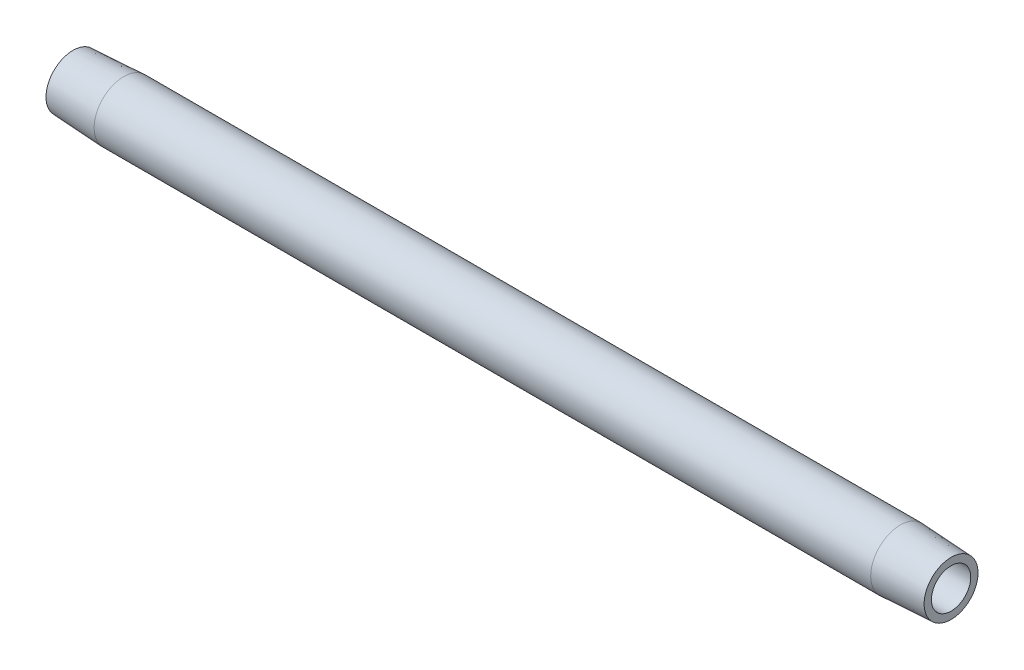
ISO-10303-21;
HEADER;
FILE_DESCRIPTION(('STEP AP214'),'2;1');
FILE_NAME('part.step','',(''),(''),'','','');
FILE_SCHEMA(('AUTOMOTIVE_DESIGN { 1 0 10303 214 1 1 1 1 }'));
ENDSEC;
DATA;
#1=APPLICATION_CONTEXT('core data for automotive mechanical design processes');
#2=APPLICATION_PROTOCOL_DEFINITION('international standard','automotive_design',2000,#1);
#3=PRODUCT_CONTEXT('',#1,'mechanical');
#4=PRODUCT('Part','Part','',(#3));
#5=PRODUCT_RELATED_PRODUCT_CATEGORY('part','',(#4));
#6=PRODUCT_DEFINITION_FORMATION('','',#4);
#7=PRODUCT_DEFINITION_CONTEXT('part definition',#1,'design');
#8=PRODUCT_DEFINITION('design','',#6,#7);
#9=PRODUCT_DEFINITION_SHAPE('','',#8);
#10=(LENGTH_UNIT() NAMED_UNIT(*) SI_UNIT(.MILLI.,.METRE.));
#11=(NAMED_UNIT(*) PLANE_ANGLE_UNIT() SI_UNIT($,.RADIAN.));
#12=(NAMED_UNIT(*) SI_UNIT($,.STERADIAN.) SOLID_ANGLE_UNIT());
#13=UNCERTAINTY_MEASURE_WITH_UNIT(LENGTH_MEASURE(1.E-05),#10,'distance_accuracy_value','');
#14=(GEOMETRIC_REPRESENTATION_CONTEXT(3) GLOBAL_UNCERTAINTY_ASSIGNED_CONTEXT((#13)) GLOBAL_UNIT_ASSIGNED_CONTEXT((#10,
#11,#12)) REPRESENTATION_CONTEXT('',''));
#15=CARTESIAN_POINT('',(0.,0.,0.));
#16=DIRECTION('',(0.,0.,1.));
#17=DIRECTION('',(1.,0.,0.));
#18=AXIS2_PLACEMENT_3D('',#15,#16,#17);
#19=CARTESIAN_POINT('',(0.476141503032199,0.,0.));
#20=DIRECTION('',(-1.,0.,0.));
#21=DIRECTION('',(0.,0.,1.));
#22=AXIS2_PLACEMENT_3D('',#19,#20,#21);
#23=CYLINDRICAL_SURFACE('',#22,5.14349999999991);
#24=CARTESIAN_POINT('',(8.8100393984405,0.,0.));
#25=DIRECTION('',(-1.,0.,0.));
#26=DIRECTION('',(0.,0.,1.));
#27=AXIS2_PLACEMENT_3D('',#24,#25,#26);
#28=CIRCLE('',#27,5.14349999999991);
#29=CARTESIAN_POINT('',(8.8100393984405,0.,5.14349999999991));
#30=VERTEX_POINT('',#29);
#31=EDGE_CURVE('E10',#30,#30,#28,.T.);
#32=ORIENTED_EDGE('',*,*,#31,.F.);
#33=EDGE_LOOP('',(#32));
#34=FACE_BOUND('',#33,.T.);
#35=CARTESIAN_POINT('',(143.589960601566,0.,0.));
#36=DIRECTION('',(-1.,0.,0.));
#37=DIRECTION('',(0.,0.,1.));
#38=AXIS2_PLACEMENT_3D('',#35,#36,#37);
#39=CIRCLE('',#38,5.14349999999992);
#40=CARTESIAN_POINT('',(143.589960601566,0.,5.14349999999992));
#41=VERTEX_POINT('',#40);
#42=EDGE_CURVE('E52',#41,#41,#39,.T.);
#43=ORIENTED_EDGE('',*,*,#42,.T.);
#44=EDGE_LOOP('',(#43));
#45=FACE_BOUND('',#44,.T.);
#46=ADVANCED_FACE('F30',(#34,#45),#23,.T.);
#47=CARTESIAN_POINT('',(8.8100393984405,0.,0.));
#48=DIRECTION('',(1.,0.,0.));
#49=DIRECTION('',(0.,0.,-1.));
#50=AXIS2_PLACEMENT_3D('',#47,#48,#49);
#51=CONICAL_SURFACE('',#50,5.14349999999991,0.0523598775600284);
#52=CARTESIAN_POINT('',(0.,0.,0.));
#53=DIRECTION('',(-1.,0.,0.));
#54=DIRECTION('',(0.,0.,1.));
#55=AXIS2_PLACEMENT_3D('',#52,#53,#54);
#56=CIRCLE('',#55,4.68178539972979);
#57=CARTESIAN_POINT('',(0.,0.,4.68178539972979));
#58=VERTEX_POINT('',#57);
#59=EDGE_CURVE('E36',#58,#58,#56,.T.);
#60=ORIENTED_EDGE('',*,*,#59,.F.);
#61=EDGE_LOOP('',(#60));
#62=FACE_BOUND('',#61,.T.);
#63=ORIENTED_EDGE('',*,*,#31,.T.);
#64=EDGE_LOOP('',(#63));
#65=FACE_BOUND('',#64,.T.);
#66=ADVANCED_FACE('F77',(#62,#65),#51,.T.);
#67=CARTESIAN_POINT('',(0.,4.68178539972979,0.));
#68=DIRECTION('',(1.,0.,0.));
#69=DIRECTION('',(0.,0.,-1.));
#70=AXIS2_PLACEMENT_3D('',#67,#68,#69);
#71=PLANE('',#70);
#72=CARTESIAN_POINT('',(0.,0.,0.));
#73=DIRECTION('',(-1.,0.,0.));
#74=DIRECTION('',(0.,0.,1.));
#75=AXIS2_PLACEMENT_3D('',#72,#73,#74);
#76=CIRCLE('',#75,3.4163);
#77=CARTESIAN_POINT('',(0.,0.,3.4163));
#78=VERTEX_POINT('',#77);
#79=EDGE_CURVE('E40',#78,#78,#76,.T.);
#80=ORIENTED_EDGE('',*,*,#79,.F.);
#81=EDGE_LOOP('',(#80));
#82=FACE_BOUND('',#81,.T.);
#83=ORIENTED_EDGE('',*,*,#59,.T.);
#84=EDGE_LOOP('',(#83));
#85=FACE_BOUND('',#84,.T.);
#86=ADVANCED_FACE('F72',(#82,#85),#71,.F.);
#87=CARTESIAN_POINT('',(0.476141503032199,0.,0.));
#88=DIRECTION('',(-1.,0.,0.));
#89=DIRECTION('',(0.,0.,1.));
#90=AXIS2_PLACEMENT_3D('',#87,#88,#89);
#91=CYLINDRICAL_SURFACE('',#90,3.4163);
#92=CARTESIAN_POINT('',(152.4,0.,0.));
#93=DIRECTION('',(-1.,0.,0.));
#94=DIRECTION('',(0.,0.,1.));
#95=AXIS2_PLACEMENT_3D('',#92,#93,#94);
#96=CIRCLE('',#95,3.41630000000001);
#97=CARTESIAN_POINT('',(152.4,0.,3.41630000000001));
#98=VERTEX_POINT('',#97);
#99=EDGE_CURVE('E44',#98,#98,#96,.T.);
#100=ORIENTED_EDGE('',*,*,#99,.F.);
#101=EDGE_LOOP('',(#100));
#102=FACE_BOUND('',#101,.T.);
#103=ORIENTED_EDGE('',*,*,#79,.T.);
#104=EDGE_LOOP('',(#103));
#105=FACE_BOUND('',#104,.T.);
#106=ADVANCED_FACE('F66',(#102,#105),#91,.F.);
#107=CARTESIAN_POINT('',(152.4,3.41630000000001,0.));
#108=DIRECTION('',(-1.,0.,0.));
#109=DIRECTION('',(0.,0.,1.));
#110=AXIS2_PLACEMENT_3D('',#107,#108,#109);
#111=PLANE('',#110);
#112=CARTESIAN_POINT('',(152.4,0.,0.));
#113=DIRECTION('',(-1.,0.,0.));
#114=DIRECTION('',(0.,0.,1.));
#115=AXIS2_PLACEMENT_3D('',#112,#113,#114);
#116=CIRCLE('',#115,4.68178539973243);
#117=CARTESIAN_POINT('',(152.4,0.,4.68178539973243));
#118=VERTEX_POINT('',#117);
#119=EDGE_CURVE('E49',#118,#118,#116,.T.);
#120=ORIENTED_EDGE('',*,*,#119,.F.);
#121=EDGE_LOOP('',(#120));
#122=FACE_BOUND('',#121,.T.);
#123=ORIENTED_EDGE('',*,*,#99,.T.);
#124=EDGE_LOOP('',(#123));
#125=FACE_BOUND('',#124,.T.);
#126=ADVANCED_FACE('F60',(#122,#125),#111,.F.);
#127=CARTESIAN_POINT('',(152.4,0.,0.));
#128=DIRECTION('',(-1.,0.,0.));
#129=DIRECTION('',(0.,0.,1.));
#130=AXIS2_PLACEMENT_3D('',#127,#128,#129);
#131=CONICAL_SURFACE('',#130,4.68178539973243,0.0523598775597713);
#132=ORIENTED_EDGE('',*,*,#42,.F.);
#133=EDGE_LOOP('',(#132));
#134=FACE_BOUND('',#133,.T.);
#135=ORIENTED_EDGE('',*,*,#119,.T.);
#136=EDGE_LOOP('',(#135));
#137=FACE_BOUND('',#136,.T.);
#138=ADVANCED_FACE('F57',(#134,#137),#131,.T.);
#139=CLOSED_SHELL('',(#46,#66,#86,#106,#126,#138));
#140=MANIFOLD_SOLID_BREP('B2',#139);
#141=ADVANCED_BREP_SHAPE_REPRESENTATION('',(#18,#140),#14);
#142=SHAPE_DEFINITION_REPRESENTATION(#9,#141);
ENDSEC;
END-ISO-10303-21;
